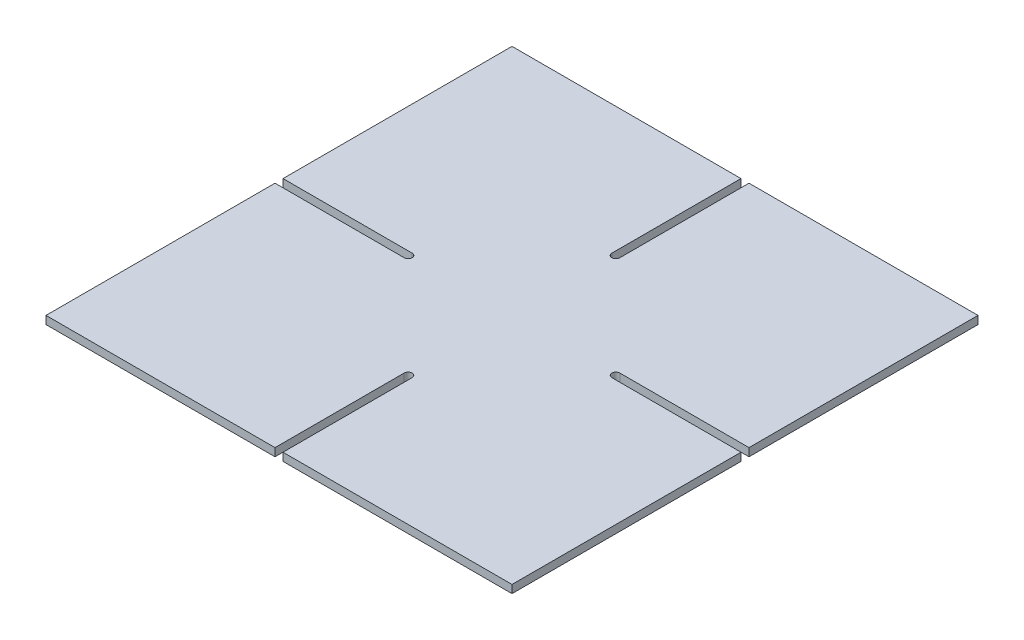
ISO-10303-21;
HEADER;
FILE_DESCRIPTION(('STEP AP214'),'2;1');
FILE_NAME('part.step','',(''),(''),'','','');
FILE_SCHEMA(('AUTOMOTIVE_DESIGN { 1 0 10303 214 1 1 1 1 }'));
ENDSEC;
DATA;
#1=APPLICATION_CONTEXT('core data for automotive mechanical design processes');
#2=APPLICATION_PROTOCOL_DEFINITION('international standard','automotive_design',2000,#1);
#3=PRODUCT_CONTEXT('',#1,'mechanical');
#4=PRODUCT('Part','Part','',(#3));
#5=PRODUCT_RELATED_PRODUCT_CATEGORY('part','',(#4));
#6=PRODUCT_DEFINITION_FORMATION('','',#4);
#7=PRODUCT_DEFINITION_CONTEXT('part definition',#1,'design');
#8=PRODUCT_DEFINITION('design','',#6,#7);
#9=PRODUCT_DEFINITION_SHAPE('','',#8);
#10=(LENGTH_UNIT() NAMED_UNIT(*) SI_UNIT(.MILLI.,.METRE.));
#11=(NAMED_UNIT(*) PLANE_ANGLE_UNIT() SI_UNIT($,.RADIAN.));
#12=(NAMED_UNIT(*) SI_UNIT($,.STERADIAN.) SOLID_ANGLE_UNIT());
#13=UNCERTAINTY_MEASURE_WITH_UNIT(LENGTH_MEASURE(1.E-05),#10,'distance_accuracy_value','');
#14=(GEOMETRIC_REPRESENTATION_CONTEXT(3) GLOBAL_UNCERTAINTY_ASSIGNED_CONTEXT((#13)) GLOBAL_UNIT_ASSIGNED_CONTEXT((#10,
#11,#12)) REPRESENTATION_CONTEXT('',''));
#15=CARTESIAN_POINT('',(0.,0.,0.));
#16=DIRECTION('',(0.,0.,1.));
#17=DIRECTION('',(1.,0.,0.));
#18=AXIS2_PLACEMENT_3D('',#15,#16,#17);
#19=CARTESIAN_POINT('',(175.,6.,175.));
#20=DIRECTION('',(-1.,0.,0.));
#21=DIRECTION('',(0.,0.,1.));
#22=AXIS2_PLACEMENT_3D('',#19,#20,#21);
#23=PLANE('',#22);
#24=DIRECTION('',(0.,0.,-1.));
#25=VECTOR('',#24,1.);
#26=CARTESIAN_POINT('',(175.,0.,175.));
#27=LINE('',#26,#25);
#28=CARTESIAN_POINT('',(175.,0.,175.));
#29=VERTEX_POINT('',#28);
#30=CARTESIAN_POINT('',(175.,0.,3.));
#31=VERTEX_POINT('',#30);
#32=EDGE_CURVE('E213',#29,#31,#27,.T.);
#33=ORIENTED_EDGE('',*,*,#32,.T.);
#34=DIRECTION('',(0.,1.,0.));
#35=VECTOR('',#34,1.);
#36=CARTESIAN_POINT('',(175.,-34.,3.));
#37=LINE('',#36,#35);
#38=CARTESIAN_POINT('',(175.,6.,3.));
#39=VERTEX_POINT('',#38);
#40=EDGE_CURVE('E294',#31,#39,#37,.T.);
#41=ORIENTED_EDGE('',*,*,#40,.T.);
#42=DIRECTION('',(0.,0.,-1.));
#43=VECTOR('',#42,1.);
#44=CARTESIAN_POINT('',(175.,6.,175.));
#45=LINE('',#44,#43);
#46=CARTESIAN_POINT('',(175.,6.,175.));
#47=VERTEX_POINT('',#46);
#48=EDGE_CURVE('E198',#47,#39,#45,.T.);
#49=ORIENTED_EDGE('',*,*,#48,.F.);
#50=DIRECTION('',(0.,-1.,0.));
#51=VECTOR('',#50,1.);
#52=CARTESIAN_POINT('',(175.,6.,175.));
#53=LINE('',#52,#51);
#54=EDGE_CURVE('E212',#47,#29,#53,.T.);
#55=ORIENTED_EDGE('',*,*,#54,.T.);
#56=EDGE_LOOP('',(#33,#41,#49,#55));
#57=FACE_BOUND('',#56,.T.);
#58=ADVANCED_FACE('F36',(#57),#23,.F.);
#59=CARTESIAN_POINT('',(-175.,6.,-175.));
#60=DIRECTION('',(0.,0.,1.));
#61=DIRECTION('',(1.,0.,0.));
#62=AXIS2_PLACEMENT_3D('',#59,#60,#61);
#63=PLANE('',#62);
#64=DIRECTION('',(-1.,0.,0.));
#65=VECTOR('',#64,1.);
#66=CARTESIAN_POINT('',(-175.,0.,-175.));
#67=LINE('',#66,#65);
#68=CARTESIAN_POINT('',(175.,0.,-175.));
#69=VERTEX_POINT('',#68);
#70=CARTESIAN_POINT('',(2.99999999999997,0.,-175.));
#71=VERTEX_POINT('',#70);
#72=EDGE_CURVE('E218',#69,#71,#67,.T.);
#73=ORIENTED_EDGE('',*,*,#72,.T.);
#74=DIRECTION('',(0.,1.,0.));
#75=VECTOR('',#74,1.);
#76=CARTESIAN_POINT('',(2.99999999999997,-34.,-175.));
#77=LINE('',#76,#75);
#78=CARTESIAN_POINT('',(2.99999999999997,6.,-175.));
#79=VERTEX_POINT('',#78);
#80=EDGE_CURVE('E361',#71,#79,#77,.T.);
#81=ORIENTED_EDGE('',*,*,#80,.T.);
#82=DIRECTION('',(-1.,0.,0.));
#83=VECTOR('',#82,1.);
#84=CARTESIAN_POINT('',(-175.,6.,-175.));
#85=LINE('',#84,#83);
#86=CARTESIAN_POINT('',(175.,6.,-175.));
#87=VERTEX_POINT('',#86);
#88=EDGE_CURVE('E197',#87,#79,#85,.T.);
#89=ORIENTED_EDGE('',*,*,#88,.F.);
#90=DIRECTION('',(0.,-1.,0.));
#91=VECTOR('',#90,1.);
#92=CARTESIAN_POINT('',(175.,6.,-175.));
#93=LINE('',#92,#91);
#94=EDGE_CURVE('E235',#87,#69,#93,.T.);
#95=ORIENTED_EDGE('',*,*,#94,.T.);
#96=EDGE_LOOP('',(#73,#81,#89,#95));
#97=FACE_BOUND('',#96,.T.);
#98=ADVANCED_FACE('F359',(#97),#63,.F.);
#99=CARTESIAN_POINT('',(-175.,6.,175.));
#100=DIRECTION('',(1.,0.,0.));
#101=DIRECTION('',(0.,0.,-1.));
#102=AXIS2_PLACEMENT_3D('',#99,#100,#101);
#103=PLANE('',#102);
#104=DIRECTION('',(0.,0.,1.));
#105=VECTOR('',#104,1.);
#106=CARTESIAN_POINT('',(-175.,0.,175.));
#107=LINE('',#106,#105);
#108=CARTESIAN_POINT('',(-175.,0.,-175.));
#109=VERTEX_POINT('',#108);
#110=CARTESIAN_POINT('',(-175.,0.,-3.));
#111=VERTEX_POINT('',#110);
#112=EDGE_CURVE('E222',#109,#111,#107,.T.);
#113=ORIENTED_EDGE('',*,*,#112,.T.);
#114=DIRECTION('',(0.,1.,0.));
#115=VECTOR('',#114,1.);
#116=CARTESIAN_POINT('',(-175.,-34.,-3.));
#117=LINE('',#116,#115);
#118=CARTESIAN_POINT('',(-175.,6.,-3.));
#119=VERTEX_POINT('',#118);
#120=EDGE_CURVE('E271',#111,#119,#117,.T.);
#121=ORIENTED_EDGE('',*,*,#120,.T.);
#122=DIRECTION('',(0.,0.,1.));
#123=VECTOR('',#122,1.);
#124=CARTESIAN_POINT('',(-175.,6.,175.));
#125=LINE('',#124,#123);
#126=CARTESIAN_POINT('',(-175.,6.,-175.));
#127=VERTEX_POINT('',#126);
#128=EDGE_CURVE('E206',#127,#119,#125,.T.);
#129=ORIENTED_EDGE('',*,*,#128,.F.);
#130=DIRECTION('',(0.,-1.,0.));
#131=VECTOR('',#130,1.);
#132=CARTESIAN_POINT('',(-175.,6.,-175.));
#133=LINE('',#132,#131);
#134=EDGE_CURVE('E195',#127,#109,#133,.T.);
#135=ORIENTED_EDGE('',*,*,#134,.T.);
#136=EDGE_LOOP('',(#113,#121,#129,#135));
#137=FACE_BOUND('',#136,.T.);
#138=ADVANCED_FACE('F269',(#137),#103,.F.);
#139=CARTESIAN_POINT('',(-175.,6.,175.));
#140=DIRECTION('',(0.,0.,-1.));
#141=DIRECTION('',(-1.,0.,0.));
#142=AXIS2_PLACEMENT_3D('',#139,#140,#141);
#143=PLANE('',#142);
#144=DIRECTION('',(1.,0.,0.));
#145=VECTOR('',#144,1.);
#146=CARTESIAN_POINT('',(-175.,0.,175.));
#147=LINE('',#146,#145);
#148=CARTESIAN_POINT('',(-175.,0.,175.));
#149=VERTEX_POINT('',#148);
#150=CARTESIAN_POINT('',(-3.00000000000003,0.,175.));
#151=VERTEX_POINT('',#150);
#152=EDGE_CURVE('E226',#149,#151,#147,.T.);
#153=ORIENTED_EDGE('',*,*,#152,.T.);
#154=DIRECTION('',(0.,1.,0.));
#155=VECTOR('',#154,1.);
#156=CARTESIAN_POINT('',(-3.00000000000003,-34.,175.));
#157=LINE('',#156,#155);
#158=CARTESIAN_POINT('',(-3.00000000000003,6.,175.));
#159=VERTEX_POINT('',#158);
#160=EDGE_CURVE('E312',#151,#159,#157,.T.);
#161=ORIENTED_EDGE('',*,*,#160,.T.);
#162=DIRECTION('',(1.,0.,0.));
#163=VECTOR('',#162,1.);
#164=CARTESIAN_POINT('',(-175.,6.,175.));
#165=LINE('',#164,#163);
#166=CARTESIAN_POINT('',(-175.,6.,175.));
#167=VERTEX_POINT('',#166);
#168=EDGE_CURVE('E209',#167,#159,#165,.T.);
#169=ORIENTED_EDGE('',*,*,#168,.F.);
#170=DIRECTION('',(0.,-1.,0.));
#171=VECTOR('',#170,1.);
#172=CARTESIAN_POINT('',(-175.,6.,175.));
#173=LINE('',#172,#171);
#174=EDGE_CURVE('E231',#167,#149,#173,.T.);
#175=ORIENTED_EDGE('',*,*,#174,.T.);
#176=EDGE_LOOP('',(#153,#161,#169,#175));
#177=FACE_BOUND('',#176,.T.);
#178=ADVANCED_FACE('F386',(#177),#143,.F.);
#179=CARTESIAN_POINT('',(175.,6.,-3.));
#180=VERTEX_POINT('',#179);
#181=EDGE_CURVE('E202',#180,#87,#45,.T.);
#182=ORIENTED_EDGE('',*,*,#181,.F.);
#183=DIRECTION('',(0.,1.,0.));
#184=VECTOR('',#183,1.);
#185=CARTESIAN_POINT('',(175.,-34.,-3.));
#186=LINE('',#185,#184);
#187=CARTESIAN_POINT('',(175.,0.,-3.));
#188=VERTEX_POINT('',#187);
#189=EDGE_CURVE('E287',#188,#180,#186,.T.);
#190=ORIENTED_EDGE('',*,*,#189,.F.);
#191=EDGE_CURVE('E217',#188,#69,#27,.T.);
#192=ORIENTED_EDGE('',*,*,#191,.T.);
#193=ORIENTED_EDGE('',*,*,#94,.F.);
#194=EDGE_LOOP('',(#182,#190,#192,#193));
#195=FACE_BOUND('',#194,.T.);
#196=ADVANCED_FACE('F38',(#195),#23,.F.);
#197=CARTESIAN_POINT('',(-3.00000000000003,6.,-175.));
#198=VERTEX_POINT('',#197);
#199=EDGE_CURVE('E186',#198,#127,#85,.T.);
#200=ORIENTED_EDGE('',*,*,#199,.F.);
#201=DIRECTION('',(0.,1.,0.));
#202=VECTOR('',#201,1.);
#203=CARTESIAN_POINT('',(-3.00000000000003,-34.,-175.));
#204=LINE('',#203,#202);
#205=CARTESIAN_POINT('',(-3.00000000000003,0.,-175.));
#206=VERTEX_POINT('',#205);
#207=EDGE_CURVE('E170',#206,#198,#204,.T.);
#208=ORIENTED_EDGE('',*,*,#207,.F.);
#209=EDGE_CURVE('E216',#206,#109,#67,.T.);
#210=ORIENTED_EDGE('',*,*,#209,.T.);
#211=ORIENTED_EDGE('',*,*,#134,.F.);
#212=EDGE_LOOP('',(#200,#208,#210,#211));
#213=FACE_BOUND('',#212,.T.);
#214=ADVANCED_FACE('F193',(#213),#63,.F.);
#215=CARTESIAN_POINT('',(-175.,6.,3.));
#216=VERTEX_POINT('',#215);
#217=EDGE_CURVE('E200',#216,#167,#125,.T.);
#218=ORIENTED_EDGE('',*,*,#217,.F.);
#219=DIRECTION('',(0.,1.,0.));
#220=VECTOR('',#219,1.);
#221=CARTESIAN_POINT('',(-175.,-34.,3.));
#222=LINE('',#221,#220);
#223=CARTESIAN_POINT('',(-175.,0.,3.));
#224=VERTEX_POINT('',#223);
#225=EDGE_CURVE('E279',#224,#216,#222,.T.);
#226=ORIENTED_EDGE('',*,*,#225,.F.);
#227=EDGE_CURVE('E221',#224,#149,#107,.T.);
#228=ORIENTED_EDGE('',*,*,#227,.T.);
#229=ORIENTED_EDGE('',*,*,#174,.F.);
#230=EDGE_LOOP('',(#218,#226,#228,#229));
#231=FACE_BOUND('',#230,.T.);
#232=ADVANCED_FACE('F381',(#231),#103,.F.);
#233=CARTESIAN_POINT('',(2.99999999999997,6.,175.));
#234=VERTEX_POINT('',#233);
#235=EDGE_CURVE('E208',#234,#47,#165,.T.);
#236=ORIENTED_EDGE('',*,*,#235,.F.);
#237=DIRECTION('',(0.,1.,0.));
#238=VECTOR('',#237,1.);
#239=CARTESIAN_POINT('',(2.99999999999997,-34.,175.));
#240=LINE('',#239,#238);
#241=CARTESIAN_POINT('',(2.99999999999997,0.,175.));
#242=VERTEX_POINT('',#241);
#243=EDGE_CURVE('E305',#242,#234,#240,.T.);
#244=ORIENTED_EDGE('',*,*,#243,.F.);
#245=EDGE_CURVE('E225',#242,#29,#147,.T.);
#246=ORIENTED_EDGE('',*,*,#245,.T.);
#247=ORIENTED_EDGE('',*,*,#54,.F.);
#248=EDGE_LOOP('',(#236,#244,#246,#247));
#249=FACE_BOUND('',#248,.T.);
#250=ADVANCED_FACE('F335',(#249),#143,.F.);
#251=CARTESIAN_POINT('',(0.,6.,0.));
#252=DIRECTION('',(0.,-1.,0.));
#253=DIRECTION('',(0.,0.,-1.));
#254=AXIS2_PLACEMENT_3D('',#251,#252,#253);
#255=PLANE('',#254);
#256=ORIENTED_EDGE('',*,*,#88,.T.);
#257=DIRECTION('',(0.,0.,-1.));
#258=VECTOR('',#257,1.);
#259=CARTESIAN_POINT('',(2.99999999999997,6.,-175.));
#260=LINE('',#259,#258);
#261=CARTESIAN_POINT('',(3.00000000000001,6.,-78.));
#262=VERTEX_POINT('',#261);
#263=EDGE_CURVE('E180',#262,#79,#260,.T.);
#264=ORIENTED_EDGE('',*,*,#263,.F.);
#265=CARTESIAN_POINT('',(0.,6.,-78.));
#266=DIRECTION('',(0.,1.,0.));
#267=DIRECTION('',(0.,0.,1.));
#268=AXIS2_PLACEMENT_3D('',#265,#266,#267);
#269=CIRCLE('',#268,3.);
#270=CARTESIAN_POINT('',(-3.00000000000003,6.,-78.));
#271=VERTEX_POINT('',#270);
#272=EDGE_CURVE('E190',#271,#262,#269,.T.);
#273=ORIENTED_EDGE('',*,*,#272,.F.);
#274=DIRECTION('',(0.,0.,1.));
#275=VECTOR('',#274,1.);
#276=CARTESIAN_POINT('',(-3.00000000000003,6.,-175.));
#277=LINE('',#276,#275);
#278=EDGE_CURVE('E173',#198,#271,#277,.T.);
#279=ORIENTED_EDGE('',*,*,#278,.F.);
#280=ORIENTED_EDGE('',*,*,#199,.T.);
#281=ORIENTED_EDGE('',*,*,#128,.T.);
#282=DIRECTION('',(-1.,0.,0.));
#283=VECTOR('',#282,1.);
#284=CARTESIAN_POINT('',(-175.,6.,-3.));
#285=LINE('',#284,#283);
#286=CARTESIAN_POINT('',(-78.,6.,-3.));
#287=VERTEX_POINT('',#286);
#288=EDGE_CURVE('E274',#287,#119,#285,.T.);
#289=ORIENTED_EDGE('',*,*,#288,.F.);
#290=CARTESIAN_POINT('',(-78.,6.,0.));
#291=DIRECTION('',(0.,1.,0.));
#292=DIRECTION('',(0.,0.,1.));
#293=AXIS2_PLACEMENT_3D('',#290,#291,#292);
#294=CIRCLE('',#293,3.);
#295=CARTESIAN_POINT('',(-78.,6.,3.));
#296=VERTEX_POINT('',#295);
#297=EDGE_CURVE('E277',#296,#287,#294,.T.);
#298=ORIENTED_EDGE('',*,*,#297,.F.);
#299=DIRECTION('',(1.,0.,0.));
#300=VECTOR('',#299,1.);
#301=CARTESIAN_POINT('',(-175.,6.,3.));
#302=LINE('',#301,#300);
#303=EDGE_CURVE('E191',#216,#296,#302,.T.);
#304=ORIENTED_EDGE('',*,*,#303,.F.);
#305=ORIENTED_EDGE('',*,*,#217,.T.);
#306=ORIENTED_EDGE('',*,*,#168,.T.);
#307=DIRECTION('',(0.,0.,1.));
#308=VECTOR('',#307,1.);
#309=CARTESIAN_POINT('',(-3.00000000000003,6.,175.));
#310=LINE('',#309,#308);
#311=CARTESIAN_POINT('',(-3.,6.,78.));
#312=VERTEX_POINT('',#311);
#313=EDGE_CURVE('E307',#312,#159,#310,.T.);
#314=ORIENTED_EDGE('',*,*,#313,.F.);
#315=CARTESIAN_POINT('',(0.,6.,78.));
#316=DIRECTION('',(0.,1.,0.));
#317=DIRECTION('',(0.,0.,1.));
#318=AXIS2_PLACEMENT_3D('',#315,#316,#317);
#319=CIRCLE('',#318,3.);
#320=CARTESIAN_POINT('',(2.99999999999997,6.,78.));
#321=VERTEX_POINT('',#320);
#322=EDGE_CURVE('E316',#321,#312,#319,.T.);
#323=ORIENTED_EDGE('',*,*,#322,.F.);
#324=DIRECTION('',(0.,0.,-1.));
#325=VECTOR('',#324,1.);
#326=CARTESIAN_POINT('',(2.99999999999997,6.,175.));
#327=LINE('',#326,#325);
#328=EDGE_CURVE('E297',#234,#321,#327,.T.);
#329=ORIENTED_EDGE('',*,*,#328,.F.);
#330=ORIENTED_EDGE('',*,*,#235,.T.);
#331=ORIENTED_EDGE('',*,*,#48,.T.);
#332=DIRECTION('',(1.,0.,0.));
#333=VECTOR('',#332,1.);
#334=CARTESIAN_POINT('',(175.,6.,3.));
#335=LINE('',#334,#333);
#336=CARTESIAN_POINT('',(78.,6.,3.00000000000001));
#337=VERTEX_POINT('',#336);
#338=EDGE_CURVE('E289',#337,#39,#335,.T.);
#339=ORIENTED_EDGE('',*,*,#338,.F.);
#340=CARTESIAN_POINT('',(78.,6.,0.));
#341=DIRECTION('',(0.,1.,0.));
#342=DIRECTION('',(0.,0.,1.));
#343=AXIS2_PLACEMENT_3D('',#340,#341,#342);
#344=CIRCLE('',#343,3.);
#345=CARTESIAN_POINT('',(78.,6.,-3.));
#346=VERTEX_POINT('',#345);
#347=EDGE_CURVE('E299',#346,#337,#344,.T.);
#348=ORIENTED_EDGE('',*,*,#347,.F.);
#349=DIRECTION('',(-1.,0.,0.));
#350=VECTOR('',#349,1.);
#351=CARTESIAN_POINT('',(175.,6.,-3.));
#352=LINE('',#351,#350);
#353=EDGE_CURVE('E302',#180,#346,#352,.T.);
#354=ORIENTED_EDGE('',*,*,#353,.F.);
#355=ORIENTED_EDGE('',*,*,#181,.T.);
#356=EDGE_LOOP('',(#256,#264,#273,#279,#280,#281,#289,#298,#304,#305,#306,#314,#323,#329,#330,
#331,#339,#348,#354,#355));
#357=FACE_BOUND('',#356,.T.);
#358=ADVANCED_FACE('F184',(#357),#255,.F.);
#359=CARTESIAN_POINT('',(0.,0.,0.));
#360=DIRECTION('',(0.,-1.,0.));
#361=DIRECTION('',(0.,0.,-1.));
#362=AXIS2_PLACEMENT_3D('',#359,#360,#361);
#363=PLANE('',#362);
#364=DIRECTION('',(0.,0.,1.));
#365=VECTOR('',#364,1.);
#366=CARTESIAN_POINT('',(2.99999999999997,0.,0.));
#367=LINE('',#366,#365);
#368=CARTESIAN_POINT('',(3.00000000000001,0.,-78.));
#369=VERTEX_POINT('',#368);
#370=EDGE_CURVE('E11',#71,#369,#367,.T.);
#371=ORIENTED_EDGE('',*,*,#370,.F.);
#372=ORIENTED_EDGE('',*,*,#72,.F.);
#373=ORIENTED_EDGE('',*,*,#191,.F.);
#374=DIRECTION('',(1.,0.,0.));
#375=VECTOR('',#374,1.);
#376=CARTESIAN_POINT('',(0.,0.,-3.));
#377=LINE('',#376,#375);
#378=CARTESIAN_POINT('',(78.,0.,-3.));
#379=VERTEX_POINT('',#378);
#380=EDGE_CURVE('E245',#379,#188,#377,.T.);
#381=ORIENTED_EDGE('',*,*,#380,.F.);
#382=CARTESIAN_POINT('',(78.,0.,0.));
#383=DIRECTION('',(0.,-1.,0.));
#384=DIRECTION('',(0.,0.,-1.));
#385=AXIS2_PLACEMENT_3D('',#382,#383,#384);
#386=CIRCLE('',#385,3.);
#387=CARTESIAN_POINT('',(78.,0.,3.00000000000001));
#388=VERTEX_POINT('',#387);
#389=EDGE_CURVE('E247',#388,#379,#386,.T.);
#390=ORIENTED_EDGE('',*,*,#389,.F.);
#391=DIRECTION('',(-1.,0.,0.));
#392=VECTOR('',#391,1.);
#393=CARTESIAN_POINT('',(0.,0.,3.));
#394=LINE('',#393,#392);
#395=EDGE_CURVE('E250',#31,#388,#394,.T.);
#396=ORIENTED_EDGE('',*,*,#395,.F.);
#397=ORIENTED_EDGE('',*,*,#32,.F.);
#398=ORIENTED_EDGE('',*,*,#245,.F.);
#399=DIRECTION('',(0.,0.,1.));
#400=VECTOR('',#399,1.);
#401=CARTESIAN_POINT('',(2.99999999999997,0.,0.));
#402=LINE('',#401,#400);
#403=CARTESIAN_POINT('',(2.99999999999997,0.,78.));
#404=VERTEX_POINT('',#403);
#405=EDGE_CURVE('E238',#404,#242,#402,.T.);
#406=ORIENTED_EDGE('',*,*,#405,.F.);
#407=CARTESIAN_POINT('',(0.,0.,78.));
#408=DIRECTION('',(0.,-1.,0.));
#409=DIRECTION('',(0.,0.,-1.));
#410=AXIS2_PLACEMENT_3D('',#407,#408,#409);
#411=CIRCLE('',#410,3.);
#412=CARTESIAN_POINT('',(-3.,0.,78.));
#413=VERTEX_POINT('',#412);
#414=EDGE_CURVE('E240',#413,#404,#411,.T.);
#415=ORIENTED_EDGE('',*,*,#414,.F.);
#416=DIRECTION('',(0.,0.,-1.));
#417=VECTOR('',#416,1.);
#418=CARTESIAN_POINT('',(-3.00000000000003,0.,0.));
#419=LINE('',#418,#417);
#420=EDGE_CURVE('E243',#151,#413,#419,.T.);
#421=ORIENTED_EDGE('',*,*,#420,.F.);
#422=ORIENTED_EDGE('',*,*,#152,.F.);
#423=ORIENTED_EDGE('',*,*,#227,.F.);
#424=DIRECTION('',(-1.,0.,0.));
#425=VECTOR('',#424,1.);
#426=CARTESIAN_POINT('',(0.,0.,3.));
#427=LINE('',#426,#425);
#428=CARTESIAN_POINT('',(-78.,0.,3.));
#429=VERTEX_POINT('',#428);
#430=EDGE_CURVE('E252',#429,#224,#427,.T.);
#431=ORIENTED_EDGE('',*,*,#430,.F.);
#432=CARTESIAN_POINT('',(-78.,0.,0.));
#433=DIRECTION('',(0.,-1.,0.));
#434=DIRECTION('',(0.,0.,-1.));
#435=AXIS2_PLACEMENT_3D('',#432,#433,#434);
#436=CIRCLE('',#435,3.);
#437=CARTESIAN_POINT('',(-78.,0.,-3.));
#438=VERTEX_POINT('',#437);
#439=EDGE_CURVE('E254',#438,#429,#436,.T.);
#440=ORIENTED_EDGE('',*,*,#439,.F.);
#441=DIRECTION('',(1.,0.,0.));
#442=VECTOR('',#441,1.);
#443=CARTESIAN_POINT('',(0.,0.,-3.));
#444=LINE('',#443,#442);
#445=EDGE_CURVE('E256',#111,#438,#444,.T.);
#446=ORIENTED_EDGE('',*,*,#445,.F.);
#447=ORIENTED_EDGE('',*,*,#112,.F.);
#448=ORIENTED_EDGE('',*,*,#209,.F.);
#449=DIRECTION('',(0.,0.,-1.));
#450=VECTOR('',#449,1.);
#451=CARTESIAN_POINT('',(-3.00000000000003,0.,0.));
#452=LINE('',#451,#450);
#453=CARTESIAN_POINT('',(-3.00000000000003,0.,-78.));
#454=VERTEX_POINT('',#453);
#455=EDGE_CURVE('E176',#454,#206,#452,.T.);
#456=ORIENTED_EDGE('',*,*,#455,.F.);
#457=CARTESIAN_POINT('',(0.,0.,-78.));
#458=DIRECTION('',(0.,-1.,0.));
#459=DIRECTION('',(0.,0.,-1.));
#460=AXIS2_PLACEMENT_3D('',#457,#458,#459);
#461=CIRCLE('',#460,3.);
#462=EDGE_CURVE('E44',#369,#454,#461,.T.);
#463=ORIENTED_EDGE('',*,*,#462,.F.);
#464=EDGE_LOOP('',(#371,#372,#373,#381,#390,#396,#397,#398,#406,#415,#421,#422,#423,#431,#440,
#446,#447,#448,#456,#463));
#465=FACE_BOUND('',#464,.T.);
#466=ADVANCED_FACE('F265',(#465),#363,.T.);
#467=CARTESIAN_POINT('',(-3.00000000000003,-34.,175.));
#468=DIRECTION('',(-1.,0.,0.));
#469=DIRECTION('',(0.,0.,1.));
#470=AXIS2_PLACEMENT_3D('',#467,#468,#469);
#471=PLANE('',#470);
#472=ORIENTED_EDGE('',*,*,#420,.T.);
#473=DIRECTION('',(0.,1.,0.));
#474=VECTOR('',#473,1.);
#475=CARTESIAN_POINT('',(-3.,-34.,78.));
#476=LINE('',#475,#474);
#477=EDGE_CURVE('E310',#413,#312,#476,.T.);
#478=ORIENTED_EDGE('',*,*,#477,.T.);
#479=ORIENTED_EDGE('',*,*,#313,.T.);
#480=ORIENTED_EDGE('',*,*,#160,.F.);
#481=EDGE_LOOP('',(#472,#478,#479,#480));
#482=FACE_BOUND('',#481,.T.);
#483=ADVANCED_FACE('F388',(#482),#471,.F.);
#484=CARTESIAN_POINT('',(0.,-34.,78.));
#485=DIRECTION('',(0.,1.,0.));
#486=DIRECTION('',(0.,0.,1.));
#487=AXIS2_PLACEMENT_3D('',#484,#485,#486);
#488=CYLINDRICAL_SURFACE('',#487,3.);
#489=ORIENTED_EDGE('',*,*,#414,.T.);
#490=DIRECTION('',(0.,1.,0.));
#491=VECTOR('',#490,1.);
#492=CARTESIAN_POINT('',(2.99999999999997,-34.,78.));
#493=LINE('',#492,#491);
#494=EDGE_CURVE('E308',#404,#321,#493,.T.);
#495=ORIENTED_EDGE('',*,*,#494,.T.);
#496=ORIENTED_EDGE('',*,*,#322,.T.);
#497=ORIENTED_EDGE('',*,*,#477,.F.);
#498=EDGE_LOOP('',(#489,#495,#496,#497));
#499=FACE_BOUND('',#498,.T.);
#500=ADVANCED_FACE('F328',(#499),#488,.F.);
#501=CARTESIAN_POINT('',(2.99999999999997,-34.,175.));
#502=DIRECTION('',(1.,0.,0.));
#503=DIRECTION('',(0.,0.,-1.));
#504=AXIS2_PLACEMENT_3D('',#501,#502,#503);
#505=PLANE('',#504);
#506=ORIENTED_EDGE('',*,*,#405,.T.);
#507=ORIENTED_EDGE('',*,*,#243,.T.);
#508=ORIENTED_EDGE('',*,*,#328,.T.);
#509=ORIENTED_EDGE('',*,*,#494,.F.);
#510=EDGE_LOOP('',(#506,#507,#508,#509));
#511=FACE_BOUND('',#510,.T.);
#512=ADVANCED_FACE('F322',(#511),#505,.F.);
#513=CARTESIAN_POINT('',(175.,-34.,3.));
#514=DIRECTION('',(0.,0.,1.));
#515=DIRECTION('',(1.,0.,0.));
#516=AXIS2_PLACEMENT_3D('',#513,#514,#515);
#517=PLANE('',#516);
#518=ORIENTED_EDGE('',*,*,#395,.T.);
#519=DIRECTION('',(0.,1.,0.));
#520=VECTOR('',#519,1.);
#521=CARTESIAN_POINT('',(78.,-34.,3.00000000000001));
#522=LINE('',#521,#520);
#523=EDGE_CURVE('E292',#388,#337,#522,.T.);
#524=ORIENTED_EDGE('',*,*,#523,.T.);
#525=ORIENTED_EDGE('',*,*,#338,.T.);
#526=ORIENTED_EDGE('',*,*,#40,.F.);
#527=EDGE_LOOP('',(#518,#524,#525,#526));
#528=FACE_BOUND('',#527,.T.);
#529=ADVANCED_FACE('F343',(#528),#517,.F.);
#530=CARTESIAN_POINT('',(78.,-34.,0.));
#531=DIRECTION('',(0.,1.,0.));
#532=DIRECTION('',(0.,0.,1.));
#533=AXIS2_PLACEMENT_3D('',#530,#531,#532);
#534=CYLINDRICAL_SURFACE('',#533,3.);
#535=ORIENTED_EDGE('',*,*,#389,.T.);
#536=DIRECTION('',(0.,1.,0.));
#537=VECTOR('',#536,1.);
#538=CARTESIAN_POINT('',(78.,-34.,-3.));
#539=LINE('',#538,#537);
#540=EDGE_CURVE('E290',#379,#346,#539,.T.);
#541=ORIENTED_EDGE('',*,*,#540,.T.);
#542=ORIENTED_EDGE('',*,*,#347,.T.);
#543=ORIENTED_EDGE('',*,*,#523,.F.);
#544=EDGE_LOOP('',(#535,#541,#542,#543));
#545=FACE_BOUND('',#544,.T.);
#546=ADVANCED_FACE('F349',(#545),#534,.F.);
#547=CARTESIAN_POINT('',(175.,-34.,-3.));
#548=DIRECTION('',(0.,0.,-1.));
#549=DIRECTION('',(-1.,0.,0.));
#550=AXIS2_PLACEMENT_3D('',#547,#548,#549);
#551=PLANE('',#550);
#552=ORIENTED_EDGE('',*,*,#380,.T.);
#553=ORIENTED_EDGE('',*,*,#189,.T.);
#554=ORIENTED_EDGE('',*,*,#353,.T.);
#555=ORIENTED_EDGE('',*,*,#540,.F.);
#556=EDGE_LOOP('',(#552,#553,#554,#555));
#557=FACE_BOUND('',#556,.T.);
#558=ADVANCED_FACE('F488',(#557),#551,.F.);
#559=CARTESIAN_POINT('',(-175.,-34.,-3.));
#560=DIRECTION('',(0.,0.,-1.));
#561=DIRECTION('',(-1.,0.,0.));
#562=AXIS2_PLACEMENT_3D('',#559,#560,#561);
#563=PLANE('',#562);
#564=ORIENTED_EDGE('',*,*,#445,.T.);
#565=DIRECTION('',(0.,1.,0.));
#566=VECTOR('',#565,1.);
#567=CARTESIAN_POINT('',(-78.,-34.,-3.));
#568=LINE('',#567,#566);
#569=EDGE_CURVE('E369',#438,#287,#568,.T.);
#570=ORIENTED_EDGE('',*,*,#569,.T.);
#571=ORIENTED_EDGE('',*,*,#288,.T.);
#572=ORIENTED_EDGE('',*,*,#120,.F.);
#573=EDGE_LOOP('',(#564,#570,#571,#572));
#574=FACE_BOUND('',#573,.T.);
#575=ADVANCED_FACE('F371',(#574),#563,.F.);
#576=CARTESIAN_POINT('',(-78.,-34.,0.));
#577=DIRECTION('',(0.,1.,0.));
#578=DIRECTION('',(0.,0.,1.));
#579=AXIS2_PLACEMENT_3D('',#576,#577,#578);
#580=CYLINDRICAL_SURFACE('',#579,3.);
#581=ORIENTED_EDGE('',*,*,#439,.T.);
#582=DIRECTION('',(0.,1.,0.));
#583=VECTOR('',#582,1.);
#584=CARTESIAN_POINT('',(-78.,-34.,3.));
#585=LINE('',#584,#583);
#586=EDGE_CURVE('E59',#429,#296,#585,.T.);
#587=ORIENTED_EDGE('',*,*,#586,.T.);
#588=ORIENTED_EDGE('',*,*,#297,.T.);
#589=ORIENTED_EDGE('',*,*,#569,.F.);
#590=EDGE_LOOP('',(#581,#587,#588,#589));
#591=FACE_BOUND('',#590,.T.);
#592=ADVANCED_FACE('F374',(#591),#580,.F.);
#593=CARTESIAN_POINT('',(-175.,-34.,3.));
#594=DIRECTION('',(0.,0.,1.));
#595=DIRECTION('',(1.,0.,0.));
#596=AXIS2_PLACEMENT_3D('',#593,#594,#595);
#597=PLANE('',#596);
#598=ORIENTED_EDGE('',*,*,#430,.T.);
#599=ORIENTED_EDGE('',*,*,#225,.T.);
#600=ORIENTED_EDGE('',*,*,#303,.T.);
#601=ORIENTED_EDGE('',*,*,#586,.F.);
#602=EDGE_LOOP('',(#598,#599,#600,#601));
#603=FACE_BOUND('',#602,.T.);
#604=ADVANCED_FACE('F376',(#603),#597,.F.);
#605=CARTESIAN_POINT('',(2.99999999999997,-34.,-175.));
#606=DIRECTION('',(1.,0.,0.));
#607=DIRECTION('',(0.,0.,-1.));
#608=AXIS2_PLACEMENT_3D('',#605,#606,#607);
#609=PLANE('',#608);
#610=ORIENTED_EDGE('',*,*,#370,.T.);
#611=DIRECTION('',(0.,1.,0.));
#612=VECTOR('',#611,1.);
#613=CARTESIAN_POINT('',(3.00000000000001,-34.,-78.));
#614=LINE('',#613,#612);
#615=EDGE_CURVE('E262',#369,#262,#614,.T.);
#616=ORIENTED_EDGE('',*,*,#615,.T.);
#617=ORIENTED_EDGE('',*,*,#263,.T.);
#618=ORIENTED_EDGE('',*,*,#80,.F.);
#619=EDGE_LOOP('',(#610,#616,#617,#618));
#620=FACE_BOUND('',#619,.T.);
#621=ADVANCED_FACE('F521',(#620),#609,.F.);
#622=CARTESIAN_POINT('',(0.,-34.,-78.));
#623=DIRECTION('',(0.,1.,0.));
#624=DIRECTION('',(0.,0.,1.));
#625=AXIS2_PLACEMENT_3D('',#622,#623,#624);
#626=CYLINDRICAL_SURFACE('',#625,3.);
#627=ORIENTED_EDGE('',*,*,#462,.T.);
#628=DIRECTION('',(0.,1.,0.));
#629=VECTOR('',#628,1.);
#630=CARTESIAN_POINT('',(-3.00000000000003,-34.,-78.));
#631=LINE('',#630,#629);
#632=EDGE_CURVE('E51',#454,#271,#631,.T.);
#633=ORIENTED_EDGE('',*,*,#632,.T.);
#634=ORIENTED_EDGE('',*,*,#272,.T.);
#635=ORIENTED_EDGE('',*,*,#615,.F.);
#636=EDGE_LOOP('',(#627,#633,#634,#635));
#637=FACE_BOUND('',#636,.T.);
#638=ADVANCED_FACE('F261',(#637),#626,.F.);
#639=CARTESIAN_POINT('',(-3.00000000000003,-34.,-175.));
#640=DIRECTION('',(-1.,0.,0.));
#641=DIRECTION('',(0.,0.,1.));
#642=AXIS2_PLACEMENT_3D('',#639,#640,#641);
#643=PLANE('',#642);
#644=ORIENTED_EDGE('',*,*,#455,.T.);
#645=ORIENTED_EDGE('',*,*,#207,.T.);
#646=ORIENTED_EDGE('',*,*,#278,.T.);
#647=ORIENTED_EDGE('',*,*,#632,.F.);
#648=EDGE_LOOP('',(#644,#645,#646,#647));
#649=FACE_BOUND('',#648,.T.);
#650=ADVANCED_FACE('F172',(#649),#643,.F.);
#651=CLOSED_SHELL('',(#58,#98,#138,#178,#196,#214,#232,#250,#358,#466,#483,#500,#512,#529,#546,
#558,#575,#592,#604,#621,#638,#650));
#652=MANIFOLD_SOLID_BREP('B2',#651);
#653=ADVANCED_BREP_SHAPE_REPRESENTATION('',(#18,#652),#14);
#654=SHAPE_DEFINITION_REPRESENTATION(#9,#653);
ENDSEC;
END-ISO-10303-21;
